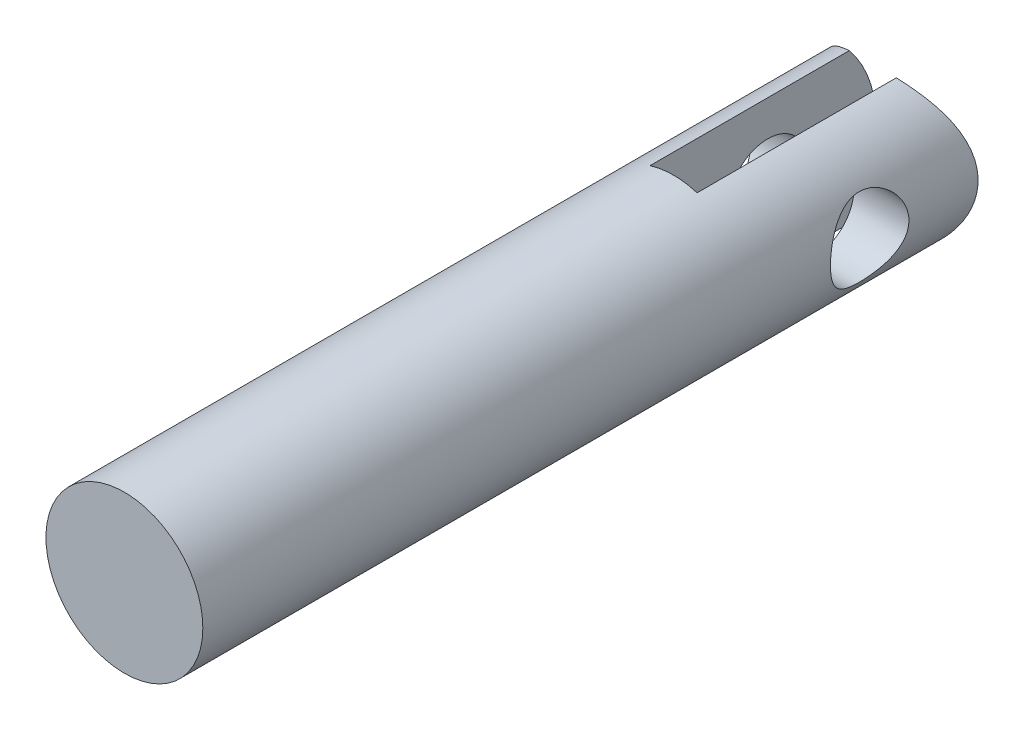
ISO-10303-21;
HEADER;
FILE_DESCRIPTION(('STEP AP214'),'2;1');
FILE_NAME('part.step','',(''),(''),'','','');
FILE_SCHEMA(('AUTOMOTIVE_DESIGN { 1 0 10303 214 1 1 1 1 }'));
ENDSEC;
DATA;
#1=APPLICATION_CONTEXT('core data for automotive mechanical design processes');
#2=APPLICATION_PROTOCOL_DEFINITION('international standard','automotive_design',2000,#1);
#3=PRODUCT_CONTEXT('',#1,'mechanical');
#4=PRODUCT('Part','Part','',(#3));
#5=PRODUCT_RELATED_PRODUCT_CATEGORY('part','',(#4));
#6=PRODUCT_DEFINITION_FORMATION('','',#4);
#7=PRODUCT_DEFINITION_CONTEXT('part definition',#1,'design');
#8=PRODUCT_DEFINITION('design','',#6,#7);
#9=PRODUCT_DEFINITION_SHAPE('','',#8);
#10=(LENGTH_UNIT() NAMED_UNIT(*) SI_UNIT(.MILLI.,.METRE.));
#11=(NAMED_UNIT(*) PLANE_ANGLE_UNIT() SI_UNIT($,.RADIAN.));
#12=(NAMED_UNIT(*) SI_UNIT($,.STERADIAN.) SOLID_ANGLE_UNIT());
#13=UNCERTAINTY_MEASURE_WITH_UNIT(LENGTH_MEASURE(1.E-05),#10,'distance_accuracy_value','');
#14=(GEOMETRIC_REPRESENTATION_CONTEXT(3) GLOBAL_UNCERTAINTY_ASSIGNED_CONTEXT((#13)) GLOBAL_UNIT_ASSIGNED_CONTEXT((#10,
#11,#12)) REPRESENTATION_CONTEXT('',''));
#15=CARTESIAN_POINT('',(0.,0.,0.));
#16=DIRECTION('',(0.,0.,1.));
#17=DIRECTION('',(1.,0.,0.));
#18=AXIS2_PLACEMENT_3D('',#15,#16,#17);
#19=CARTESIAN_POINT('',(0.,0.,95.));
#20=DIRECTION('',(0.,0.,-1.));
#21=DIRECTION('',(-1.,0.,0.));
#22=AXIS2_PLACEMENT_3D('',#19,#20,#21);
#23=CYLINDRICAL_SURFACE('',#22,10.);
#24=CARTESIAN_POINT('',(-10.,0.,15.));
#25=CARTESIAN_POINT('',(-9.99999960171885,-0.131488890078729,14.999999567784));
#26=CARTESIAN_POINT('',(-9.99740053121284,-0.262986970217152,14.9948072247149));
#27=CARTESIAN_POINT('',(-9.98706977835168,-0.525014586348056,14.974097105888));
#28=CARTESIAN_POINT('',(-9.97933586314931,-0.655543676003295,14.958574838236));
#29=CARTESIAN_POINT('',(-9.95892066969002,-0.914783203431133,14.9173592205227));
#30=CARTESIAN_POINT('',(-9.94623233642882,-1.04349077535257,14.8916513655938));
#31=CARTESIAN_POINT('',(-9.91622716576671,-1.29802636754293,14.8303493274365));
#32=CARTESIAN_POINT('',(-9.89890843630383,-1.42385318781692,14.7947511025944));
#33=CARTESIAN_POINT('',(-9.86015430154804,-1.67121386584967,14.7142215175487));
#34=CARTESIAN_POINT('',(-9.83873709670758,-1.79276399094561,14.6693313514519));
#35=CARTESIAN_POINT('',(-9.79224427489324,-2.0314444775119,14.5705512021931));
#36=CARTESIAN_POINT('',(-9.7671672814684,-2.14857315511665,14.5166578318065));
#37=CARTESIAN_POINT('',(-9.68730860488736,-2.49222561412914,14.342200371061));
#38=CARTESIAN_POINT('',(-9.6278546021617,-2.71128846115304,14.2087692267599));
#39=CARTESIAN_POINT('',(-9.49780663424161,-3.13758045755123,13.9023947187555));
#40=CARTESIAN_POINT('',(-9.42675632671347,-3.34329192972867,13.7275493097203));
#41=CARTESIAN_POINT('',(-9.28300214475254,-3.72388133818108,13.3474109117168));
#42=CARTESIAN_POINT('',(-9.21029705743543,-3.89873577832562,13.1420949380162));
#43=CARTESIAN_POINT('',(-9.06493867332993,-4.22628385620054,12.6875248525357));
#44=CARTESIAN_POINT('',(-8.99272664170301,-4.37620734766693,12.4360981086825));
#45=CARTESIAN_POINT('',(-8.89637417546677,-4.56723365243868,12.0400819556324));
#46=CARTESIAN_POINT('',(-8.86624279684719,-4.62527981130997,11.9048817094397));
#47=CARTESIAN_POINT('',(-8.81109611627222,-4.72948843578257,11.6289987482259));
#48=CARTESIAN_POINT('',(-8.78607778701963,-4.77565793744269,11.4883193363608));
#49=CARTESIAN_POINT('',(-8.74350562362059,-4.8531380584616,11.211007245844));
#50=CARTESIAN_POINT('',(-8.72559704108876,-4.88516762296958,11.0746295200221));
#51=CARTESIAN_POINT('',(-8.69596333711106,-4.93772573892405,10.7990743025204));
#52=CARTESIAN_POINT('',(-8.68423493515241,-4.95826039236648,10.6598983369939));
#53=CARTESIAN_POINT('',(-8.66746161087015,-4.98752398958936,10.3799925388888));
#54=CARTESIAN_POINT('',(-8.66241266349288,-4.99626004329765,10.2392636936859));
#55=CARTESIAN_POINT('',(-8.65921299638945,-5.00180399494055,9.9574988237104));
#56=CARTESIAN_POINT('',(-8.66106161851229,-4.99861303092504,9.81646282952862));
#57=CARTESIAN_POINT('',(-8.67093727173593,-4.98145803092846,9.55229642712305));
#58=CARTESIAN_POINT('',(-8.6781966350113,-4.96883208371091,9.4290473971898));
#59=CARTESIAN_POINT('',(-8.69773906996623,-4.93454402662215,9.18417878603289));
#60=CARTESIAN_POINT('',(-8.71002371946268,-4.91287907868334,9.06255972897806));
#61=CARTESIAN_POINT('',(-8.73921479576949,-4.86076278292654,8.82180212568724));
#62=CARTESIAN_POINT('',(-8.75612065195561,-4.83031251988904,8.70266327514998));
#63=CARTESIAN_POINT('',(-8.79403073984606,-4.76094319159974,8.46752862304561));
#64=CARTESIAN_POINT('',(-8.81503658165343,-4.72202079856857,8.35153407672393));
#65=CARTESIAN_POINT('',(-8.88436032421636,-4.59108661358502,8.00399312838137));
#66=CARTESIAN_POINT('',(-8.93828791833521,-4.48608785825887,7.77830664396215));
#67=CARTESIAN_POINT('',(-9.05517433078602,-4.24519591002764,7.34678988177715));
#68=CARTESIAN_POINT('',(-9.11813720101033,-4.10928884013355,7.14096858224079));
#69=CARTESIAN_POINT('',(-9.25565455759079,-3.79034422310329,6.72741147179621));
#70=CARTESIAN_POINT('',(-9.3306665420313,-3.60351571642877,6.52274199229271));
#71=CARTESIAN_POINT('',(-9.47739013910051,-3.19773444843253,6.14629653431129));
#72=CARTESIAN_POINT('',(-9.54910016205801,-2.97876642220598,5.97453627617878));
#73=CARTESIAN_POINT('',(-9.65034506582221,-2.62430600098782,5.74155910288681));
#74=CARTESIAN_POINT('',(-9.68370380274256,-2.4987100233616,5.66664790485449));
#75=CARTESIAN_POINT('',(-9.74663052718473,-2.24071060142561,5.52779179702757));
#76=CARTESIAN_POINT('',(-9.77620011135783,-2.1083100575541,5.46384226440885));
#77=CARTESIAN_POINT('',(-9.83067553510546,-1.83762803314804,5.34760112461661));
#78=CARTESIAN_POINT('',(-9.85558325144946,-1.69934894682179,5.29530482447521));
#79=CARTESIAN_POINT('',(-9.89999026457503,-1.41791187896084,5.20297507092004));
#80=CARTESIAN_POINT('',(-9.91949018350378,-1.27475446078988,5.16294020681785));
#81=CARTESIAN_POINT('',(-9.95109597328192,-0.996798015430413,5.09846643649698));
#82=CARTESIAN_POINT('',(-9.96368046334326,-0.862288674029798,5.07301048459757));
#83=CARTESIAN_POINT('',(-9.98343035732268,-0.591248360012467,5.0331919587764));
#84=CARTESIAN_POINT('',(-9.99059624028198,-0.454717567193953,5.01882840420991));
#85=CARTESIAN_POINT('',(-9.99930380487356,-0.180810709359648,5.00138683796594));
#86=CARTESIAN_POINT('',(-10.000847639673,-0.0434349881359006,4.99830450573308));
#87=CARTESIAN_POINT('',(-9.99827237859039,0.23104760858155,5.00345557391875));
#88=CARTESIAN_POINT('',(-9.99415353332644,0.368154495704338,5.01168847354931));
#89=CARTESIAN_POINT('',(-9.98090973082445,0.630324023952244,5.03827867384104));
#90=CARTESIAN_POINT('',(-9.97219922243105,0.755493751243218,5.05579837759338));
#91=CARTESIAN_POINT('',(-9.95027227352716,1.00380426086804,5.10017447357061));
#92=CARTESIAN_POINT('',(-9.93705440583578,1.12694438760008,5.12703382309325));
#93=CARTESIAN_POINT('',(-9.90642450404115,1.37032307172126,5.18980268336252));
#94=CARTESIAN_POINT('',(-9.88901375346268,1.49056250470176,5.22570942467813));
#95=CARTESIAN_POINT('',(-9.85039368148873,1.72747946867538,5.30622816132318));
#96=CARTESIAN_POINT('',(-9.82918290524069,1.84415561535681,5.35084349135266));
#97=CARTESIAN_POINT('',(-9.75922876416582,2.19430354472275,5.4999478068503));
#98=CARTESIAN_POINT('',(-9.70504904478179,2.42111320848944,5.61794074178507));
#99=CARTESIAN_POINT('',(-9.58719375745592,2.8523456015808,5.8855521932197));
#100=CARTESIAN_POINT('',(-9.5235141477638,3.05675873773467,6.03518418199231));
#101=CARTESIAN_POINT('',(-9.38541505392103,3.45882132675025,6.37878729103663));
#102=CARTESIAN_POINT('',(-9.31055499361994,3.65383533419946,6.57566959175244));
#103=CARTESIAN_POINT('',(-9.16310881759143,4.00930667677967,6.99967053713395));
#104=CARTESIAN_POINT('',(-9.09052430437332,4.16974010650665,7.22680992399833));
#105=CARTESIAN_POINT('',(-8.98785260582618,4.38466016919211,7.59249056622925));
#106=CARTESIAN_POINT('',(-8.95395955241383,4.4532676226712,7.72185087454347));
#107=CARTESIAN_POINT('',(-8.89022352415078,4.57918112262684,7.98689410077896));
#108=CARTESIAN_POINT('',(-8.86037871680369,4.63649228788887,8.12257412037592));
#109=CARTESIAN_POINT('',(-8.80590327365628,4.73913999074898,8.39927703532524));
#110=CARTESIAN_POINT('',(-8.78126837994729,4.78448631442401,8.54029545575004));
#111=CARTESIAN_POINT('',(-8.73822819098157,4.86265004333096,8.82669104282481));
#112=CARTESIAN_POINT('',(-8.7198219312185,4.89546938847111,8.97206753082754));
#113=CARTESIAN_POINT('',(-8.69151275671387,4.94553834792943,9.25176498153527));
#114=CARTESIAN_POINT('',(-8.6809632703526,4.96397997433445,9.38580788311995));
#115=CARTESIAN_POINT('',(-8.66606824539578,4.98993873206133,9.65528524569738));
#116=CARTESIAN_POINT('',(-8.66172205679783,4.99745700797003,9.79071955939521));
#117=CARTESIAN_POINT('',(-8.65941425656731,5.00145477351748,10.0617569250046));
#118=CARTESIAN_POINT('',(-8.66145040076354,4.99793814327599,10.1973599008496));
#119=CARTESIAN_POINT('',(-8.67181681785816,4.97992974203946,10.4675855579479));
#120=CARTESIAN_POINT('',(-8.68014683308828,4.96543842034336,10.6022082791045));
#121=CARTESIAN_POINT('',(-8.70167828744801,4.92759757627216,10.856560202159));
#122=CARTESIAN_POINT('',(-8.71433770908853,4.90522766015,10.9764825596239));
#123=CARTESIAN_POINT('',(-8.74411599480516,4.85194376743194,11.2138611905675));
#124=CARTESIAN_POINT('',(-8.76123623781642,4.82102714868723,11.331316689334));
#125=CARTESIAN_POINT('',(-8.81854231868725,4.71590306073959,11.6789171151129));
#126=CARTESIAN_POINT('',(-8.86468813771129,4.62929708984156,11.904456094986));
#127=CARTESIAN_POINT('',(-8.97142890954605,4.41907164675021,12.3531603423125));
#128=CARTESIAN_POINT('',(-9.03278633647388,4.29335633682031,12.5751480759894));
#129=CARTESIAN_POINT('',(-9.16176636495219,4.01075421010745,12.9963641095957));
#130=CARTESIAN_POINT('',(-9.22939221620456,3.85385117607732,13.1955804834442));
#131=CARTESIAN_POINT('',(-9.37311444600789,3.49102748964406,13.5907078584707));
#132=CARTESIAN_POINT('',(-9.44924162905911,3.28146736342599,13.7832760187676));
#133=CARTESIAN_POINT('',(-9.59389514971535,2.83072875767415,14.1313344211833));
#134=CARTESIAN_POINT('',(-9.66241737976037,2.58953334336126,14.2868046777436));
#135=CARTESIAN_POINT('',(-9.7541901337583,2.20753881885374,14.4886304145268));
#136=CARTESIAN_POINT('',(-9.78304209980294,2.0762551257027,14.5508670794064));
#137=CARTESIAN_POINT('',(-9.83614745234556,1.80799529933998,14.6639361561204));
#138=CARTESIAN_POINT('',(-9.8604030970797,1.67102200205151,14.7147741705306));
#139=CARTESIAN_POINT('',(-9.90354484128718,1.39269501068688,14.8043454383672));
#140=CARTESIAN_POINT('',(-9.92244264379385,1.25135162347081,14.8431050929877));
#141=CARTESIAN_POINT('',(-9.95434618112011,0.965237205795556,14.9081375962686));
#142=CARTESIAN_POINT('',(-9.96735551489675,0.820468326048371,14.934418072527));
#143=CARTESIAN_POINT('',(-9.98476387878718,0.563041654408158,14.9694745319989));
#144=CARTESIAN_POINT('',(-9.99046741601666,0.450825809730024,14.980911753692));
#145=CARTESIAN_POINT('',(-9.99808569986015,0.225742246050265,14.9961747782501));
#146=CARTESIAN_POINT('',(-10.000000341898,0.112874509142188,15.0000003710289));
#147=CARTESIAN_POINT('',(-10.,0.,15.));
#148=B_SPLINE_CURVE_WITH_KNOTS('',3,(#24,#25,#26,#27,#28,#29,#30,#31,#32,#33,#34,#35,#36,#37,
#38,#39,#40,#41,#42,#43,#44,#45,#46,#47,#48,#49,#50,#51,#52,#53,#54,#55,#56,#57,#58,#59,#60,#61,
#62,#63,#64,#65,#66,#67,#68,#69,#70,#71,#72,#73,#74,#75,#76,#77,#78,#79,#80,#81,#82,#83,#84,#85,
#86,#87,#88,#89,#90,#91,#92,#93,#94,#95,#96,#97,#98,#99,#100,#101,#102,#103,#104,#105,#106,#107,
#108,#109,#110,#111,#112,#113,#114,#115,#116,#117,#118,#119,#120,#121,#122,#123,#124,#125,#126,
#127,#128,#129,#130,#131,#132,#133,#134,#135,#136,#137,#138,#139,#140,#141,#142,#143,#144,#145,
#146,#147),.UNSPECIFIED.,.T.,.F.,(4,2,2,2,2,2,2,2,2,2,2,2,2,2,2,2,2,2,2,2,2,2,2,2,2,2,2,2,2,2,2,
2,2,2,2,2,2,2,2,2,2,2,2,2,2,2,2,2,2,2,2,2,2,2,2,2,2,2,2,2,2,4),(0.,0.39435529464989,
0.788882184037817,1.18397293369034,1.57922537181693,1.97276168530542,2.36644639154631,
3.15295441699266,3.98704440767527,4.821766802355,5.72122193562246,6.17125359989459,
6.62101803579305,7.04410338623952,7.46696393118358,7.88956954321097,8.3121348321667,
8.68401534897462,9.05601271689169,9.42796417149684,9.8000619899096,10.56083380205,
11.3219478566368,12.1795688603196,13.03759852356,13.4870830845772,13.9363776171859,
14.3854908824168,14.8345524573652,15.2464230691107,15.6582572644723,16.0699337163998,
16.4815919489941,16.8612200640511,17.240968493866,17.6206008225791,18.0003788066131,
18.7808755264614,19.5617052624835,20.4192132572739,21.2773121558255,21.7277011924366,
22.1778856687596,22.6277007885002,23.0774462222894,23.4840267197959,23.8905646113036,
24.2969595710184,24.703337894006,25.0708552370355,25.4384863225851,26.1732662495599,
26.9574126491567,27.7419678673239,28.6218519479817,29.5022089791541,29.9460734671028,
30.3897193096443,30.8323885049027,31.2747867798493,31.6133053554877,31.9518332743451),.UNSPECIFIED.);
#149=CARTESIAN_POINT('',(-10.,0.,15.));
#150=VERTEX_POINT('',#149);
#151=EDGE_CURVE('E97',#150,#150,#148,.T.);
#152=ORIENTED_EDGE('',*,*,#151,.T.);
#153=EDGE_LOOP('',(#152));
#154=FACE_BOUND('',#153,.T.);
#155=CARTESIAN_POINT('',(10.,0.,5.));
#156=CARTESIAN_POINT('',(9.99999960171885,-0.131488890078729,5.00000043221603));
#157=CARTESIAN_POINT('',(9.99740053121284,-0.262986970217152,5.00519277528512));
#158=CARTESIAN_POINT('',(9.98706977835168,-0.525014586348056,5.02590289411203));
#159=CARTESIAN_POINT('',(9.97933586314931,-0.655543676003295,5.04142516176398));
#160=CARTESIAN_POINT('',(9.95892066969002,-0.914783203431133,5.08264077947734));
#161=CARTESIAN_POINT('',(9.94623233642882,-1.04349077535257,5.10834863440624));
#162=CARTESIAN_POINT('',(9.91622716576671,-1.29802636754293,5.16965067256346));
#163=CARTESIAN_POINT('',(9.89890843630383,-1.42385318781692,5.20524889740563));
#164=CARTESIAN_POINT('',(9.86015430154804,-1.67121386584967,5.2857784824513));
#165=CARTESIAN_POINT('',(9.83873709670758,-1.79276399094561,5.33066864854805));
#166=CARTESIAN_POINT('',(9.79224427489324,-2.0314444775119,5.42944879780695));
#167=CARTESIAN_POINT('',(9.7671672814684,-2.14857315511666,5.48334216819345));
#168=CARTESIAN_POINT('',(9.68730860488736,-2.49222561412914,5.65779962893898));
#169=CARTESIAN_POINT('',(9.6278546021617,-2.71128846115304,5.79123077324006));
#170=CARTESIAN_POINT('',(9.49780663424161,-3.13758045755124,6.09760528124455));
#171=CARTESIAN_POINT('',(9.42675632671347,-3.34329192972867,6.27245069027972));
#172=CARTESIAN_POINT('',(9.28300214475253,-3.72388133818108,6.65258908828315));
#173=CARTESIAN_POINT('',(9.21029705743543,-3.89873577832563,6.85790506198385));
#174=CARTESIAN_POINT('',(9.06493867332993,-4.22628385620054,7.31247514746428));
#175=CARTESIAN_POINT('',(8.99272664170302,-4.37620734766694,7.56390189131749));
#176=CARTESIAN_POINT('',(8.89637417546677,-4.56723365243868,7.95991804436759));
#177=CARTESIAN_POINT('',(8.86624279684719,-4.62527981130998,8.09511829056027));
#178=CARTESIAN_POINT('',(8.81109611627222,-4.72948843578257,8.37100125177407));
#179=CARTESIAN_POINT('',(8.78607778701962,-4.77565793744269,8.51168066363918));
#180=CARTESIAN_POINT('',(8.74350562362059,-4.8531380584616,8.78899275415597));
#181=CARTESIAN_POINT('',(8.72559704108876,-4.88516762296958,8.92537047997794));
#182=CARTESIAN_POINT('',(8.69596333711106,-4.93772573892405,9.20092569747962));
#183=CARTESIAN_POINT('',(8.68423493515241,-4.95826039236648,9.34010166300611));
#184=CARTESIAN_POINT('',(8.66746161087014,-4.98752398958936,9.62000746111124));
#185=CARTESIAN_POINT('',(8.66241266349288,-4.99626004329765,9.7607363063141));
#186=CARTESIAN_POINT('',(8.65921299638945,-5.00180399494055,10.0425011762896));
#187=CARTESIAN_POINT('',(8.66106161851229,-4.99861303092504,10.1835371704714));
#188=CARTESIAN_POINT('',(8.67093727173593,-4.98145803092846,10.447703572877));
#189=CARTESIAN_POINT('',(8.6781966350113,-4.96883208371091,10.5709526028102));
#190=CARTESIAN_POINT('',(8.69773906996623,-4.93454402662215,10.8158212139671));
#191=CARTESIAN_POINT('',(8.71002371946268,-4.91287907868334,10.9374402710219));
#192=CARTESIAN_POINT('',(8.73921479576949,-4.86076278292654,11.1781978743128));
#193=CARTESIAN_POINT('',(8.75612065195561,-4.83031251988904,11.29733672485));
#194=CARTESIAN_POINT('',(8.79403073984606,-4.76094319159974,11.5324713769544));
#195=CARTESIAN_POINT('',(8.81503658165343,-4.72202079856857,11.6484659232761));
#196=CARTESIAN_POINT('',(8.88436032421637,-4.59108661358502,11.9960068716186));
#197=CARTESIAN_POINT('',(8.93828791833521,-4.48608785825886,12.2216933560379));
#198=CARTESIAN_POINT('',(9.05517433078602,-4.24519591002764,12.6532101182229));
#199=CARTESIAN_POINT('',(9.11813720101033,-4.10928884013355,12.8590314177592));
#200=CARTESIAN_POINT('',(9.25565455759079,-3.79034422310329,13.2725885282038));
#201=CARTESIAN_POINT('',(9.3306665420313,-3.60351571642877,13.4772580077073));
#202=CARTESIAN_POINT('',(9.47739013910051,-3.19773444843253,13.8537034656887));
#203=CARTESIAN_POINT('',(9.54910016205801,-2.97876642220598,14.0254637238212));
#204=CARTESIAN_POINT('',(9.65034506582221,-2.62430600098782,14.2584408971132));
#205=CARTESIAN_POINT('',(9.68370380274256,-2.49871002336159,14.3333520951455));
#206=CARTESIAN_POINT('',(9.74663052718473,-2.2407106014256,14.4722082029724));
#207=CARTESIAN_POINT('',(9.77620011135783,-2.1083100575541,14.5361577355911));
#208=CARTESIAN_POINT('',(9.83067553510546,-1.83762803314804,14.6523988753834));
#209=CARTESIAN_POINT('',(9.85558325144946,-1.69934894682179,14.7046951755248));
#210=CARTESIAN_POINT('',(9.89999026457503,-1.41791187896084,14.79702492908));
#211=CARTESIAN_POINT('',(9.91949018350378,-1.27475446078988,14.8370597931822));
#212=CARTESIAN_POINT('',(9.95109597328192,-0.996798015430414,14.901533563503));
#213=CARTESIAN_POINT('',(9.96368046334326,-0.862288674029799,14.9269895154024));
#214=CARTESIAN_POINT('',(9.98343035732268,-0.591248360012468,14.9668080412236));
#215=CARTESIAN_POINT('',(9.99059624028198,-0.454717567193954,14.9811715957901));
#216=CARTESIAN_POINT('',(9.99930380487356,-0.180810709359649,14.9986131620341));
#217=CARTESIAN_POINT('',(10.000847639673,-0.0434349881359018,15.0016954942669));
#218=CARTESIAN_POINT('',(9.99827237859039,0.231047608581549,14.9965444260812));
#219=CARTESIAN_POINT('',(9.99415353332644,0.368154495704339,14.9883115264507));
#220=CARTESIAN_POINT('',(9.98090973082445,0.630324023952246,14.961721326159));
#221=CARTESIAN_POINT('',(9.97219922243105,0.75549375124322,14.9442016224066));
#222=CARTESIAN_POINT('',(9.95027227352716,1.00380426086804,14.8998255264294));
#223=CARTESIAN_POINT('',(9.93705440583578,1.12694438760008,14.8729661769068));
#224=CARTESIAN_POINT('',(9.90642450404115,1.37032307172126,14.8101973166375));
#225=CARTESIAN_POINT('',(9.88901375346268,1.49056250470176,14.7742905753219));
#226=CARTESIAN_POINT('',(9.85039368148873,1.72747946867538,14.6937718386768));
#227=CARTESIAN_POINT('',(9.82918290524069,1.84415561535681,14.6491565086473));
#228=CARTESIAN_POINT('',(9.75922876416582,2.19430354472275,14.5000521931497));
#229=CARTESIAN_POINT('',(9.70504904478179,2.42111320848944,14.3820592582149));
#230=CARTESIAN_POINT('',(9.58719375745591,2.8523456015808,14.1144478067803));
#231=CARTESIAN_POINT('',(9.5235141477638,3.05675873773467,13.9648158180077));
#232=CARTESIAN_POINT('',(9.38541505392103,3.45882132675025,13.6212127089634));
#233=CARTESIAN_POINT('',(9.31055499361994,3.65383533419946,13.4243304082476));
#234=CARTESIAN_POINT('',(9.16310881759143,4.00930667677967,13.000329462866));
#235=CARTESIAN_POINT('',(9.09052430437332,4.16974010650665,12.7731900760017));
#236=CARTESIAN_POINT('',(8.98785260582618,4.38466016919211,12.4075094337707));
#237=CARTESIAN_POINT('',(8.95395955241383,4.4532676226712,12.2781491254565));
#238=CARTESIAN_POINT('',(8.89022352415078,4.57918112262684,12.013105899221));
#239=CARTESIAN_POINT('',(8.86037871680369,4.63649228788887,11.8774258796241));
#240=CARTESIAN_POINT('',(8.80590327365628,4.73913999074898,11.6007229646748));
#241=CARTESIAN_POINT('',(8.78126837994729,4.78448631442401,11.45970454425));
#242=CARTESIAN_POINT('',(8.73822819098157,4.86265004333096,11.1733089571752));
#243=CARTESIAN_POINT('',(8.7198219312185,4.89546938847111,11.0279324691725));
#244=CARTESIAN_POINT('',(8.69151275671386,4.94553834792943,10.7482350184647));
#245=CARTESIAN_POINT('',(8.6809632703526,4.96397997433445,10.61419211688));
#246=CARTESIAN_POINT('',(8.66606824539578,4.98993873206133,10.3447147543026));
#247=CARTESIAN_POINT('',(8.66172205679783,4.99745700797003,10.2092804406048));
#248=CARTESIAN_POINT('',(8.65941425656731,5.00145477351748,9.93824307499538));
#249=CARTESIAN_POINT('',(8.66145040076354,4.99793814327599,9.80264009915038));
#250=CARTESIAN_POINT('',(8.67181681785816,4.97992974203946,9.53241444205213));
#251=CARTESIAN_POINT('',(8.68014683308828,4.96543842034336,9.39779172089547));
#252=CARTESIAN_POINT('',(8.70167828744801,4.92759757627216,9.14343979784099));
#253=CARTESIAN_POINT('',(8.71433770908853,4.90522766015,9.02351744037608));
#254=CARTESIAN_POINT('',(8.74411599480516,4.85194376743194,8.78613880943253));
#255=CARTESIAN_POINT('',(8.76123623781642,4.82102714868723,8.66868331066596));
#256=CARTESIAN_POINT('',(8.81854231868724,4.71590306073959,8.3210828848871));
#257=CARTESIAN_POINT('',(8.86468813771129,4.62929708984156,8.095543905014));
#258=CARTESIAN_POINT('',(8.97142890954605,4.41907164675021,7.64683965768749));
#259=CARTESIAN_POINT('',(9.03278633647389,4.29335633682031,7.42485192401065));
#260=CARTESIAN_POINT('',(9.16176636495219,4.01075421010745,7.00363589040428));
#261=CARTESIAN_POINT('',(9.22939221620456,3.85385117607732,6.80441951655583));
#262=CARTESIAN_POINT('',(9.37311444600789,3.49102748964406,6.40929214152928));
#263=CARTESIAN_POINT('',(9.44924162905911,3.28146736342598,6.21672398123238));
#264=CARTESIAN_POINT('',(9.59389514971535,2.83072875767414,5.86866557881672));
#265=CARTESIAN_POINT('',(9.66241737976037,2.58953334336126,5.71319532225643));
#266=CARTESIAN_POINT('',(9.7541901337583,2.20753881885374,5.51136958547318));
#267=CARTESIAN_POINT('',(9.78304209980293,2.0762551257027,5.44913292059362));
#268=CARTESIAN_POINT('',(9.83614745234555,1.80799529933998,5.33606384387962));
#269=CARTESIAN_POINT('',(9.8604030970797,1.67102200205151,5.28522582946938));
#270=CARTESIAN_POINT('',(9.90354484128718,1.39269501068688,5.19565456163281));
#271=CARTESIAN_POINT('',(9.92244264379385,1.25135162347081,5.15689490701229));
#272=CARTESIAN_POINT('',(9.95434618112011,0.965237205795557,5.09186240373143));
#273=CARTESIAN_POINT('',(9.96735551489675,0.820468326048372,5.06558192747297));
#274=CARTESIAN_POINT('',(9.98476387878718,0.563041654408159,5.03052546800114));
#275=CARTESIAN_POINT('',(9.99046741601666,0.450825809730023,5.01908824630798));
#276=CARTESIAN_POINT('',(9.99808569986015,0.225742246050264,5.00382522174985));
#277=CARTESIAN_POINT('',(10.000000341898,0.112874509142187,4.99999962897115));
#278=CARTESIAN_POINT('',(10.,0.,5.));
#279=B_SPLINE_CURVE_WITH_KNOTS('',3,(#155,#156,#157,#158,#159,#160,#161,#162,#163,#164,#165,
#166,#167,#168,#169,#170,#171,#172,#173,#174,#175,#176,#177,#178,#179,#180,#181,#182,#183,#184,
#185,#186,#187,#188,#189,#190,#191,#192,#193,#194,#195,#196,#197,#198,#199,#200,#201,#202,#203,
#204,#205,#206,#207,#208,#209,#210,#211,#212,#213,#214,#215,#216,#217,#218,#219,#220,#221,#222,
#223,#224,#225,#226,#227,#228,#229,#230,#231,#232,#233,#234,#235,#236,#237,#238,#239,#240,#241,
#242,#243,#244,#245,#246,#247,#248,#249,#250,#251,#252,#253,#254,#255,#256,#257,#258,#259,#260,
#261,#262,#263,#264,#265,#266,#267,#268,#269,#270,#271,#272,#273,#274,#275,#276,#277,#278),
.UNSPECIFIED.,.T.,.F.,(4,2,2,2,2,2,2,2,2,2,2,2,2,2,2,2,2,2,2,2,2,2,2,2,2,2,2,2,2,2,2,2,2,2,2,2,
2,2,2,2,2,2,2,2,2,2,2,2,2,2,2,2,2,2,2,2,2,2,2,2,2,4),(0.,0.39435529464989,0.788882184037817,
1.18397293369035,1.57922537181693,1.97276168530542,2.36644639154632,3.15295441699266,
3.98704440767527,4.821766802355,5.72122193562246,6.17125359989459,6.62101803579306,
7.04410338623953,7.46696393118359,7.88956954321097,8.31213483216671,8.68401534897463,
9.05601271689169,9.42796417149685,9.8000619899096,10.56083380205,11.3219478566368,
12.1795688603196,13.03759852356,13.4870830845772,13.9363776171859,14.3854908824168,
14.8345524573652,15.2464230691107,15.6582572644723,16.0699337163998,16.4815919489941,
16.8612200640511,17.240968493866,17.6206008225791,18.0003788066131,18.7808755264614,
19.5617052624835,20.4192132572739,21.2773121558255,21.7277011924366,22.1778856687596,
22.6277007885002,23.0774462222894,23.4840267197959,23.8905646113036,24.2969595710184,
24.703337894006,25.0708552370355,25.4384863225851,26.1732662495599,26.9574126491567,
27.7419678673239,28.6218519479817,29.5022089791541,29.9460734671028,30.3897193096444,
30.8323885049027,31.2747867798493,31.6133053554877,31.9518332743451),.UNSPECIFIED.);
#280=CARTESIAN_POINT('',(10.,0.,5.));
#281=VERTEX_POINT('',#280);
#282=EDGE_CURVE('E130',#281,#281,#279,.T.);
#283=ORIENTED_EDGE('',*,*,#282,.T.);
#284=EDGE_LOOP('',(#283));
#285=FACE_BOUND('',#284,.T.);
#286=CARTESIAN_POINT('',(0.,0.,95.));
#287=DIRECTION('',(0.,0.,1.));
#288=DIRECTION('',(1.,0.,0.));
#289=AXIS2_PLACEMENT_3D('',#286,#287,#288);
#290=CIRCLE('',#289,10.);
#291=CARTESIAN_POINT('',(10.,0.,95.));
#292=VERTEX_POINT('',#291);
#293=EDGE_CURVE('E11',#292,#292,#290,.T.);
#294=ORIENTED_EDGE('',*,*,#293,.F.);
#295=EDGE_LOOP('',(#294));
#296=FACE_BOUND('',#295,.T.);
#297=DIRECTION('',(0.,0.,-1.));
#298=VECTOR('',#297,1.);
#299=CARTESIAN_POINT('',(3.,9.53939201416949,25.));
#300=LINE('',#299,#298);
#301=CARTESIAN_POINT('',(3.,9.53939201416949,25.));
#302=VERTEX_POINT('',#301);
#303=CARTESIAN_POINT('',(3.,9.53939201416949,-0.395497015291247));
#304=VERTEX_POINT('',#303);
#305=EDGE_CURVE('E83',#302,#304,#300,.T.);
#306=ORIENTED_EDGE('',*,*,#305,.F.);
#307=CARTESIAN_POINT('',(0.,0.,25.));
#308=DIRECTION('',(0.,0.,1.));
#309=DIRECTION('',(1.,0.,0.));
#310=AXIS2_PLACEMENT_3D('',#307,#308,#309);
#311=CIRCLE('',#310,10.);
#312=CARTESIAN_POINT('',(-3.,9.53939201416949,25.));
#313=VERTEX_POINT('',#312);
#314=EDGE_CURVE('E157',#302,#313,#311,.T.);
#315=ORIENTED_EDGE('',*,*,#314,.T.);
#316=DIRECTION('',(0.,0.,-1.));
#317=VECTOR('',#316,1.);
#318=CARTESIAN_POINT('',(-3.,9.53939201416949,25.));
#319=LINE('',#318,#317);
#320=CARTESIAN_POINT('',(-3.,9.53939201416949,-0.395497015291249));
#321=VERTEX_POINT('',#320);
#322=EDGE_CURVE('E152',#313,#321,#319,.T.);
#323=ORIENTED_EDGE('',*,*,#322,.T.);
#324=CARTESIAN_POINT('',(0.,10.,0.));
#325=CARTESIAN_POINT('',(0.243783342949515,9.99999702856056,-5.13300925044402E-06));
#326=CARTESIAN_POINT('',(0.487663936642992,9.99106351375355,-0.00801300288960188));
#327=CARTESIAN_POINT('',(0.973228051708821,9.95550999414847,-0.039658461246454));
#328=CARTESIAN_POINT('',(1.21490974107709,9.92887640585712,-0.0633080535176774));
#329=CARTESIAN_POINT('',(1.69449589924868,9.85837603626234,-0.125172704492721));
#330=CARTESIAN_POINT('',(1.93238875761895,9.81446410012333,-0.163425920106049));
#331=CARTESIAN_POINT('',(2.40215800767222,9.71017941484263,-0.25281893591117));
#332=CARTESIAN_POINT('',(2.63403105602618,9.64979772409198,-0.303965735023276));
#333=CARTESIAN_POINT('',(3.08797325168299,9.51419646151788,-0.41654441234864));
#334=CARTESIAN_POINT('',(3.31012042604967,9.43914148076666,-0.477861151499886));
#335=CARTESIAN_POINT('',(3.74627679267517,9.27468384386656,-0.609118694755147));
#336=CARTESIAN_POINT('',(3.96028725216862,9.1852834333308,-0.679058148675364));
#337=CARTESIAN_POINT('',(4.58929345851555,8.89668829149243,-0.898863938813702));
#338=CARTESIAN_POINT('',(4.99163494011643,8.67698697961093,-1.05881561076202));
#339=CARTESIAN_POINT('',(5.59671088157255,8.29132325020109,-1.32099255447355));
#340=CARTESIAN_POINT('',(5.81207917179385,8.14176101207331,-1.41912128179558));
#341=CARTESIAN_POINT('',(6.22991257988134,7.82665890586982,-1.61723745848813));
#342=CARTESIAN_POINT('',(6.43238005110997,7.66112196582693,-1.71722456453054));
#343=CARTESIAN_POINT('',(6.82404156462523,7.31443432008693,-1.91695503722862));
#344=CARTESIAN_POINT('',(7.01322050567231,7.13326635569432,-2.01669800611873));
#345=CARTESIAN_POINT('',(7.37739272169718,6.75594711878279,-2.21378144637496));
#346=CARTESIAN_POINT('',(7.55238502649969,6.55979482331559,-2.31112175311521));
#347=CARTESIAN_POINT('',(7.91159230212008,6.12353514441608,-2.51522098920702));
#348=CARTESIAN_POINT('',(8.09347191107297,5.88117633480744,-2.62130201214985));
#349=CARTESIAN_POINT('',(8.4359118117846,5.37846281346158,-2.82486136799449));
#350=CARTESIAN_POINT('',(8.59647480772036,5.11811039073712,-2.92234079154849));
#351=CARTESIAN_POINT('',(8.89438369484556,4.58085187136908,-3.10588802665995));
#352=CARTESIAN_POINT('',(9.03174640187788,4.30395796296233,-3.19196409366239));
#353=CARTESIAN_POINT('',(9.2813875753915,3.73526612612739,-3.35013932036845));
#354=CARTESIAN_POINT('',(9.39367141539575,3.44347140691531,-3.42224147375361));
#355=CARTESIAN_POINT('',(9.58011207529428,2.88082899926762,-3.54291012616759));
#356=CARTESIAN_POINT('',(9.65713217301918,2.6113007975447,-3.59320904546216));
#357=CARTESIAN_POINT('',(9.78860209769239,2.06453267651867,-3.67948056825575));
#358=CARTESIAN_POINT('',(9.84305344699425,1.78729327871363,-3.71545413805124));
#359=CARTESIAN_POINT('',(9.9283488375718,1.22794332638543,-3.77195393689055));
#360=CARTESIAN_POINT('',(9.95921762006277,0.945838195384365,-3.79249635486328));
#361=CARTESIAN_POINT('',(9.99683237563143,0.379329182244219,-3.81754176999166));
#362=CARTESIAN_POINT('',(10.0035817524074,0.0949256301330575,-3.82204703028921));
#363=CARTESIAN_POINT('',(9.9936594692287,-0.429890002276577,-3.81543397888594));
#364=CARTESIAN_POINT('',(9.98039847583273,-0.670404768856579,-3.80659076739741));
#365=CARTESIAN_POINT('',(9.93665840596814,-1.14916802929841,-3.77749786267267));
#366=CARTESIAN_POINT('',(9.90617970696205,-1.38741657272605,-3.75724841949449));
#367=CARTESIAN_POINT('',(9.82842632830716,-1.85993998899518,-3.7057985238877));
#368=CARTESIAN_POINT('',(9.78115177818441,-2.09421489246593,-3.67459815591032));
#369=CARTESIAN_POINT('',(9.6704192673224,-2.55727775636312,-3.60192193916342));
#370=CARTESIAN_POINT('',(9.60696060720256,-2.78606547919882,-3.560445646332));
#371=CARTESIAN_POINT('',(9.46491439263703,-3.23585987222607,-3.46826749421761));
#372=CARTESIAN_POINT('',(9.38639222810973,-3.45689545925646,-3.41760555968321));
#373=CARTESIAN_POINT('',(9.21483749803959,-3.89118270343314,-3.30789260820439));
#374=CARTESIAN_POINT('',(9.12180016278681,-4.10443177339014,-3.24883883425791));
#375=CARTESIAN_POINT('',(8.92210148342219,-4.52213262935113,-3.12343088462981));
#376=CARTESIAN_POINT('',(8.81544377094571,-4.72658674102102,-3.05707865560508));
#377=CARTESIAN_POINT('',(8.58926751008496,-5.12612990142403,-2.91815473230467));
#378=CARTESIAN_POINT('',(8.46974436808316,-5.32121556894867,-2.84558081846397));
#379=CARTESIAN_POINT('',(8.20216520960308,-5.72633268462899,-2.68553735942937));
#380=CARTESIAN_POINT('',(8.05242265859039,-5.93497240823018,-2.59736212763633));
#381=CARTESIAN_POINT('',(7.73842132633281,-6.33895305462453,-2.4162298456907));
#382=CARTESIAN_POINT('',(7.57415607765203,-6.53428798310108,-2.32327067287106));
#383=CARTESIAN_POINT('',(7.23175998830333,-6.91133768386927,-2.13423648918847));
#384=CARTESIAN_POINT('',(7.05361020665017,-7.09303316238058,-2.03815733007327));
#385=CARTESIAN_POINT('',(6.68440374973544,-7.4419925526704,-1.84488647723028));
#386=CARTESIAN_POINT('',(6.49335130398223,-7.6092611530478,-1.74769515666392));
#387=CARTESIAN_POINT('',(6.0681548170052,-7.95384017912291,-1.53905602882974));
#388=CARTESIAN_POINT('',(5.8319284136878,-8.12867089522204,-1.42774016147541));
#389=CARTESIAN_POINT('',(5.34355338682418,-8.45772734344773,-1.20940783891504));
#390=CARTESIAN_POINT('',(5.09140105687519,-8.61194825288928,-1.10239239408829));
#391=CARTESIAN_POINT('',(4.57221287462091,-8.89846481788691,-0.896431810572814));
#392=CARTESIAN_POINT('',(4.30519570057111,-9.03078719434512,-0.797476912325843));
#393=CARTESIAN_POINT('',(3.75679342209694,-9.2723363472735,-0.611480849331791));
#394=CARTESIAN_POINT('',(3.47540748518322,-9.38156178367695,-0.524440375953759));
#395=CARTESIAN_POINT('',(2.98041642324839,-9.54803274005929,-0.388720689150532));
#396=CARTESIAN_POINT('',(2.76988559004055,-9.61127015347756,-0.336123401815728));
#397=CARTESIAN_POINT('',(2.34308742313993,-9.72412503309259,-0.240992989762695));
#398=CARTESIAN_POINT('',(2.12682396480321,-9.77375145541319,-0.198453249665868));
#399=CARTESIAN_POINT('',(1.69017979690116,-9.85863206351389,-0.12499176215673));
#400=CARTESIAN_POINT('',(1.46981214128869,-9.89392565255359,-0.0940381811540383));
#401=CARTESIAN_POINT('',(1.02589546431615,-9.94974950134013,-0.0448055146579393));
#402=CARTESIAN_POINT('',(0.802348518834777,-9.97028898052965,-0.0265185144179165));
#403=CARTESIAN_POINT('',(0.481929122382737,-9.98884564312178,-0.00996857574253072));
#404=CARTESIAN_POINT('',(0.385642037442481,-9.99302611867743,-0.00623441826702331));
#405=CARTESIAN_POINT('',(0.192908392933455,-9.99860411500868,-0.00124890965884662));
#406=CARTESIAN_POINT('',(0.096461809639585,-10.0000011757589,2.03106314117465E-06));
#407=CARTESIAN_POINT('',(-0.243783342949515,-9.99999702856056,-5.13300925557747E-06));
#408=CARTESIAN_POINT('',(-0.487663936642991,-9.99106351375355,-0.00801300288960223));
#409=CARTESIAN_POINT('',(-0.97322805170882,-9.95550999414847,-0.0396584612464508));
#410=CARTESIAN_POINT('',(-1.21490974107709,-9.92887640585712,-0.0633080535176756));
#411=CARTESIAN_POINT('',(-1.69449589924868,-9.85837603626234,-0.12517270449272));
#412=CARTESIAN_POINT('',(-1.93238875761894,-9.81446410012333,-0.163425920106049));
#413=CARTESIAN_POINT('',(-2.40215800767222,-9.71017941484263,-0.25281893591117));
#414=CARTESIAN_POINT('',(-2.63403105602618,-9.64979772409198,-0.303965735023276));
#415=CARTESIAN_POINT('',(-3.087973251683,-9.51419646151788,-0.41654441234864));
#416=CARTESIAN_POINT('',(-3.31012042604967,-9.43914148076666,-0.477861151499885));
#417=CARTESIAN_POINT('',(-3.74627679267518,-9.27468384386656,-0.609118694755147));
#418=CARTESIAN_POINT('',(-3.96028725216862,-9.1852834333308,-0.679058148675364));
#419=CARTESIAN_POINT('',(-4.58929345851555,-8.89668829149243,-0.898863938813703));
#420=CARTESIAN_POINT('',(-4.99163494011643,-8.67698697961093,-1.05881561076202));
#421=CARTESIAN_POINT('',(-5.59671088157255,-8.29132325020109,-1.32099255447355));
#422=CARTESIAN_POINT('',(-5.81207917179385,-8.14176101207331,-1.41912128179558));
#423=CARTESIAN_POINT('',(-6.22991257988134,-7.82665890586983,-1.61723745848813));
#424=CARTESIAN_POINT('',(-6.43238005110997,-7.66112196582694,-1.71722456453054));
#425=CARTESIAN_POINT('',(-6.82404156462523,-7.31443432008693,-1.91695503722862));
#426=CARTESIAN_POINT('',(-7.01322050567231,-7.13326635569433,-2.01669800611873));
#427=CARTESIAN_POINT('',(-7.37739272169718,-6.75594711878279,-2.21378144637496));
#428=CARTESIAN_POINT('',(-7.55238502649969,-6.55979482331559,-2.31112175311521));
#429=CARTESIAN_POINT('',(-7.91159230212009,-6.12353514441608,-2.51522098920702));
#430=CARTESIAN_POINT('',(-8.09347191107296,-5.88117633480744,-2.62130201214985));
#431=CARTESIAN_POINT('',(-8.43591181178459,-5.37846281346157,-2.82486136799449));
#432=CARTESIAN_POINT('',(-8.59647480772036,-5.11811039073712,-2.92234079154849));
#433=CARTESIAN_POINT('',(-8.89438369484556,-4.58085187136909,-3.10588802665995));
#434=CARTESIAN_POINT('',(-9.03174640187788,-4.30395796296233,-3.19196409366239));
#435=CARTESIAN_POINT('',(-9.2813875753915,-3.73526612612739,-3.35013932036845));
#436=CARTESIAN_POINT('',(-9.39367141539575,-3.44347140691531,-3.42224147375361));
#437=CARTESIAN_POINT('',(-9.58011207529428,-2.88082899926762,-3.54291012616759));
#438=CARTESIAN_POINT('',(-9.65713217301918,-2.6113007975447,-3.59320904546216));
#439=CARTESIAN_POINT('',(-9.78860209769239,-2.06453267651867,-3.67948056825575));
#440=CARTESIAN_POINT('',(-9.84305344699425,-1.78729327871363,-3.71545413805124));
#441=CARTESIAN_POINT('',(-9.9283488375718,-1.22794332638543,-3.77195393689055));
#442=CARTESIAN_POINT('',(-9.95921762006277,-0.945838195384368,-3.79249635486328));
#443=CARTESIAN_POINT('',(-9.99683237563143,-0.379329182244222,-3.81754176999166));
#444=CARTESIAN_POINT('',(-10.0035817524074,-0.0949256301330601,-3.82204703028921));
#445=CARTESIAN_POINT('',(-9.9936594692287,0.429890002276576,-3.81543397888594));
#446=CARTESIAN_POINT('',(-9.98039847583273,0.670404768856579,-3.80659076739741));
#447=CARTESIAN_POINT('',(-9.93665840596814,1.14916802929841,-3.77749786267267));
#448=CARTESIAN_POINT('',(-9.90617970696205,1.38741657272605,-3.75724841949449));
#449=CARTESIAN_POINT('',(-9.82842632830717,1.85993998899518,-3.7057985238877));
#450=CARTESIAN_POINT('',(-9.78115177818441,2.09421489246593,-3.67459815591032));
#451=CARTESIAN_POINT('',(-9.6704192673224,2.55727775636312,-3.60192193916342));
#452=CARTESIAN_POINT('',(-9.60696060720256,2.78606547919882,-3.560445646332));
#453=CARTESIAN_POINT('',(-9.46491439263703,3.23585987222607,-3.46826749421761));
#454=CARTESIAN_POINT('',(-9.38639222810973,3.45689545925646,-3.41760555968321));
#455=CARTESIAN_POINT('',(-9.21483749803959,3.89118270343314,-3.3078926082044));
#456=CARTESIAN_POINT('',(-9.12180016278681,4.10443177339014,-3.24883883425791));
#457=CARTESIAN_POINT('',(-8.92210148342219,4.52213262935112,-3.12343088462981));
#458=CARTESIAN_POINT('',(-8.81544377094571,4.72658674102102,-3.05707865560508));
#459=CARTESIAN_POINT('',(-8.58926751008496,5.12612990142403,-2.91815473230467));
#460=CARTESIAN_POINT('',(-8.46974436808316,5.32121556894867,-2.84558081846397));
#461=CARTESIAN_POINT('',(-8.20216520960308,5.72633268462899,-2.68553735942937));
#462=CARTESIAN_POINT('',(-8.05242265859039,5.93497240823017,-2.59736212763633));
#463=CARTESIAN_POINT('',(-7.73842132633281,6.33895305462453,-2.4162298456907));
#464=CARTESIAN_POINT('',(-7.57415607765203,6.53428798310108,-2.32327067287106));
#465=CARTESIAN_POINT('',(-7.23175998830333,6.91133768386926,-2.13423648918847));
#466=CARTESIAN_POINT('',(-7.05361020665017,7.09303316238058,-2.03815733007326));
#467=CARTESIAN_POINT('',(-6.68440374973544,7.4419925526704,-1.84488647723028));
#468=CARTESIAN_POINT('',(-6.49335130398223,7.6092611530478,-1.74769515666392));
#469=CARTESIAN_POINT('',(-6.0681548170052,7.95384017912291,-1.53905602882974));
#470=CARTESIAN_POINT('',(-5.8319284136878,8.12867089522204,-1.42774016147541));
#471=CARTESIAN_POINT('',(-5.34355338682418,8.45772734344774,-1.20940783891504));
#472=CARTESIAN_POINT('',(-5.09140105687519,8.61194825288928,-1.10239239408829));
#473=CARTESIAN_POINT('',(-4.57221287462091,8.89846481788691,-0.896431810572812));
#474=CARTESIAN_POINT('',(-4.30519570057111,9.03078719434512,-0.797476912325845));
#475=CARTESIAN_POINT('',(-3.75679342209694,9.2723363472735,-0.611480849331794));
#476=CARTESIAN_POINT('',(-3.47540748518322,9.38156178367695,-0.52444037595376));
#477=CARTESIAN_POINT('',(-2.98041642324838,9.54803274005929,-0.388720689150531));
#478=CARTESIAN_POINT('',(-2.76988559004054,9.61127015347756,-0.336123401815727));
#479=CARTESIAN_POINT('',(-2.34308742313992,9.7241250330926,-0.240992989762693));
#480=CARTESIAN_POINT('',(-2.1268239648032,9.77375145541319,-0.198453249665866));
#481=CARTESIAN_POINT('',(-1.69017979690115,9.8586320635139,-0.124991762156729));
#482=CARTESIAN_POINT('',(-1.46981214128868,9.89392565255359,-0.0940381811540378));
#483=CARTESIAN_POINT('',(-1.02589546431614,9.94974950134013,-0.044805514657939));
#484=CARTESIAN_POINT('',(-0.802348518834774,9.97028898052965,-0.0265185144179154));
#485=CARTESIAN_POINT('',(-0.481929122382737,9.98884564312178,-0.0099685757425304));
#486=CARTESIAN_POINT('',(-0.385642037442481,9.99302611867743,-0.00623441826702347));
#487=CARTESIAN_POINT('',(-0.192908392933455,9.99860411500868,-0.00124890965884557));
#488=CARTESIAN_POINT('',(-0.0964618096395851,10.0000011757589,2.03106314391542E-06));
#489=CARTESIAN_POINT('',(0.,10.,0.));
#490=B_SPLINE_CURVE_WITH_KNOTS('',3,(#324,#325,#326,#327,#328,#329,#330,#331,#332,#333,#334,
#335,#336,#337,#338,#339,#340,#341,#342,#343,#344,#345,#346,#347,#348,#349,#350,#351,#352,#353,
#354,#355,#356,#357,#358,#359,#360,#361,#362,#363,#364,#365,#366,#367,#368,#369,#370,#371,#372,
#373,#374,#375,#376,#377,#378,#379,#380,#381,#382,#383,#384,#385,#386,#387,#388,#389,#390,#391,
#392,#393,#394,#395,#396,#397,#398,#399,#400,#401,#402,#403,#404,#405,#406,#407,#408,#409,#410,
#411,#412,#413,#414,#415,#416,#417,#418,#419,#420,#421,#422,#423,#424,#425,#426,#427,#428,#429,
#430,#431,#432,#433,#434,#435,#436,#437,#438,#439,#440,#441,#442,#443,#444,#445,#446,#447,#448,
#449,#450,#451,#452,#453,#454,#455,#456,#457,#458,#459,#460,#461,#462,#463,#464,#465,#466,#467,
#468,#469,#470,#471,#472,#473,#474,#475,#476,#477,#478,#479,#480,#481,#482,#483,#484,#485,#486,
#487,#488,#489),.UNSPECIFIED.,.T.,.F.,(4,2,2,2,2,2,2,2,2,2,2,2,2,2,2,2,2,2,2,2,2,2,2,2,2,2,2,2,
2,2,2,2,2,2,2,2,2,2,2,2,2,2,2,2,2,2,2,2,2,2,2,2,2,2,2,2,2,2,2,2,2,2,2,2,2,2,2,2,2,2,2,2,2,2,2,2,
2,2,2,2,2,2,4),(0.,0.731229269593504,1.46302035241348,2.19673672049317,2.93085222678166,
3.65716219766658,4.38335858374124,5.83456314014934,6.67388088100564,7.51304507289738,
8.35314796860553,9.19330826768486,10.1551588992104,11.1168873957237,12.0779158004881,
13.0387380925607,13.8918341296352,14.7448726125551,15.5970149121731,16.4490369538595,
17.1712882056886,17.8935236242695,18.6157534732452,19.3380145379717,20.0572084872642,
20.7766392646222,21.4958786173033,22.2153756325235,23.0291616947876,23.843312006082,
24.6585930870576,25.4736082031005,26.4152924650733,27.3571966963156,28.2979429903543,
29.2387438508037,29.9162015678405,30.5932124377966,31.2683492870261,31.9430638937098,
32.2323537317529,32.5216913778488,33.2529206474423,33.9847117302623,34.718428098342,
35.4525436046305,36.1788535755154,36.9050499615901,38.3562545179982,39.1955722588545,
40.0347364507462,40.8748393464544,41.7149996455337,42.6768502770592,43.6385787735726,
44.5996071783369,45.5604294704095,46.413525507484,47.2665639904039,48.1187062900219,
48.9707283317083,49.6929795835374,50.4152150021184,51.137444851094,51.8597059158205,
52.578899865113,53.298330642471,54.0175699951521,54.7370670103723,55.5508530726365,
56.3650033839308,57.1802844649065,57.9952995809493,58.9369838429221,59.8788880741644,
60.8196343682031,61.7604352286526,62.4378929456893,63.1149038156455,63.790040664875,
64.4647552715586,64.7540451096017,65.0433827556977),.UNSPECIFIED.);
#491=CARTESIAN_POINT('',(-3.,-9.53939201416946,-0.395497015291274));
#492=VERTEX_POINT('',#491);
#493=EDGE_CURVE('E94',#492,#321,#490,.T.);
#494=ORIENTED_EDGE('',*,*,#493,.F.);
#495=DIRECTION('',(0.,0.,-1.));
#496=VECTOR('',#495,1.);
#497=CARTESIAN_POINT('',(-3.,-9.53939201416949,25.));
#498=LINE('',#497,#496);
#499=CARTESIAN_POINT('',(-3.,-9.53939201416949,25.));
#500=VERTEX_POINT('',#499);
#501=EDGE_CURVE('E51',#500,#492,#498,.T.);
#502=ORIENTED_EDGE('',*,*,#501,.F.);
#503=CARTESIAN_POINT('',(0.,0.,25.));
#504=DIRECTION('',(0.,0.,1.));
#505=DIRECTION('',(1.,0.,0.));
#506=AXIS2_PLACEMENT_3D('',#503,#504,#505);
#507=CIRCLE('',#506,10.);
#508=CARTESIAN_POINT('',(3.,-9.53939201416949,25.));
#509=VERTEX_POINT('',#508);
#510=EDGE_CURVE('E90',#500,#509,#507,.T.);
#511=ORIENTED_EDGE('',*,*,#510,.T.);
#512=DIRECTION('',(0.,0.,-1.));
#513=VECTOR('',#512,1.);
#514=CARTESIAN_POINT('',(3.,-9.53939201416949,25.));
#515=LINE('',#514,#513);
#516=CARTESIAN_POINT('',(3.,-9.53939201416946,-0.395497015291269));
#517=VERTEX_POINT('',#516);
#518=EDGE_CURVE('E80',#509,#517,#515,.T.);
#519=ORIENTED_EDGE('',*,*,#518,.T.);
#520=EDGE_CURVE('E43',#304,#517,#490,.T.);
#521=ORIENTED_EDGE('',*,*,#520,.F.);
#522=EDGE_LOOP('',(#306,#315,#323,#494,#502,#511,#519,#521));
#523=FACE_BOUND('',#522,.T.);
#524=ADVANCED_FACE('F34',(#154,#285,#296,#523),#23,.T.);
#525=CARTESIAN_POINT('',(10.001,0.,11.1803398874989));
#526=DIRECTION('',(-1.,0.,0.));
#527=DIRECTION('',(0.,0.,1.));
#528=AXIS2_PLACEMENT_3D('',#525,#526,#527);
#529=CYLINDRICAL_SURFACE('',#528,15.);
#530=CARTESIAN_POINT('',(3.,0.,11.1803398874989));
#531=DIRECTION('',(1.,0.,0.));
#532=DIRECTION('',(0.,0.,-1.));
#533=AXIS2_PLACEMENT_3D('',#530,#531,#532);
#534=CIRCLE('',#533,15.);
#535=EDGE_CURVE('E76',#304,#517,#534,.F.);
#536=ORIENTED_EDGE('',*,*,#535,.F.);
#537=ORIENTED_EDGE('',*,*,#520,.T.);
#538=EDGE_LOOP('',(#536,#537));
#539=FACE_BOUND('',#538,.T.);
#540=ADVANCED_FACE('F93',(#539),#529,.T.);
#541=CARTESIAN_POINT('',(-3.,0.,11.1803398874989));
#542=DIRECTION('',(-1.,0.,0.));
#543=DIRECTION('',(0.,0.,1.));
#544=AXIS2_PLACEMENT_3D('',#541,#542,#543);
#545=CIRCLE('',#544,15.);
#546=EDGE_CURVE('E87',#492,#321,#545,.F.);
#547=ORIENTED_EDGE('',*,*,#546,.F.);
#548=ORIENTED_EDGE('',*,*,#493,.T.);
#549=EDGE_LOOP('',(#547,#548));
#550=FACE_BOUND('',#549,.T.);
#551=ADVANCED_FACE('F106',(#550),#529,.T.);
#552=CARTESIAN_POINT('',(-50.,0.,10.));
#553=DIRECTION('',(1.,0.,0.));
#554=DIRECTION('',(0.,0.,-1.));
#555=AXIS2_PLACEMENT_3D('',#552,#553,#554);
#556=CYLINDRICAL_SURFACE('',#555,5.);
#557=ORIENTED_EDGE('',*,*,#282,.F.);
#558=EDGE_LOOP('',(#557));
#559=FACE_BOUND('',#558,.T.);
#560=CARTESIAN_POINT('',(3.,0.,10.));
#561=DIRECTION('',(-1.,0.,0.));
#562=DIRECTION('',(0.,0.,1.));
#563=AXIS2_PLACEMENT_3D('',#560,#561,#562);
#564=CIRCLE('',#563,5.);
#565=CARTESIAN_POINT('',(3.,0.,15.));
#566=VERTEX_POINT('',#565);
#567=EDGE_CURVE('E38',#566,#566,#564,.F.);
#568=ORIENTED_EDGE('',*,*,#567,.F.);
#569=EDGE_LOOP('',(#568));
#570=FACE_BOUND('',#569,.T.);
#571=ADVANCED_FACE('F107',(#559,#570),#556,.F.);
#572=ORIENTED_EDGE('',*,*,#151,.F.);
#573=EDGE_LOOP('',(#572));
#574=FACE_BOUND('',#573,.T.);
#575=CARTESIAN_POINT('',(-3.,0.,10.));
#576=DIRECTION('',(1.,0.,0.));
#577=DIRECTION('',(0.,0.,-1.));
#578=AXIS2_PLACEMENT_3D('',#575,#576,#577);
#579=CIRCLE('',#578,5.);
#580=CARTESIAN_POINT('',(-3.,0.,5.));
#581=VERTEX_POINT('',#580);
#582=EDGE_CURVE('E91',#581,#581,#579,.F.);
#583=ORIENTED_EDGE('',*,*,#582,.F.);
#584=EDGE_LOOP('',(#583));
#585=FACE_BOUND('',#584,.T.);
#586=ADVANCED_FACE('F112',(#574,#585),#556,.F.);
#587=CARTESIAN_POINT('',(0.,0.,95.));
#588=DIRECTION('',(0.,0.,1.));
#589=DIRECTION('',(1.,0.,0.));
#590=AXIS2_PLACEMENT_3D('',#587,#588,#589);
#591=PLANE('',#590);
#592=ORIENTED_EDGE('',*,*,#293,.T.);
#593=EDGE_LOOP('',(#592));
#594=FACE_BOUND('',#593,.T.);
#595=ADVANCED_FACE('F110',(#594),#591,.T.);
#596=CARTESIAN_POINT('',(3.,9.53939201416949,25.));
#597=DIRECTION('',(-1.,0.,0.));
#598=DIRECTION('',(0.,0.,1.));
#599=AXIS2_PLACEMENT_3D('',#596,#597,#598);
#600=PLANE('',#599);
#601=ORIENTED_EDGE('',*,*,#518,.F.);
#602=DIRECTION('',(0.,1.,0.));
#603=VECTOR('',#602,1.);
#604=CARTESIAN_POINT('',(3.,9.53939201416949,25.));
#605=LINE('',#604,#603);
#606=EDGE_CURVE('E159',#509,#302,#605,.T.);
#607=ORIENTED_EDGE('',*,*,#606,.T.);
#608=ORIENTED_EDGE('',*,*,#305,.T.);
#609=ORIENTED_EDGE('',*,*,#535,.T.);
#610=EDGE_LOOP('',(#601,#607,#608,#609));
#611=FACE_BOUND('',#610,.T.);
#612=ORIENTED_EDGE('',*,*,#567,.T.);
#613=EDGE_LOOP('',(#612));
#614=FACE_BOUND('',#613,.T.);
#615=ADVANCED_FACE('F78',(#611,#614),#600,.T.);
#616=CARTESIAN_POINT('',(-3.,9.53939201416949,25.));
#617=DIRECTION('',(1.,0.,0.));
#618=DIRECTION('',(0.,0.,-1.));
#619=AXIS2_PLACEMENT_3D('',#616,#617,#618);
#620=PLANE('',#619);
#621=ORIENTED_EDGE('',*,*,#322,.F.);
#622=DIRECTION('',(0.,-1.,0.));
#623=VECTOR('',#622,1.);
#624=CARTESIAN_POINT('',(-3.,9.53939201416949,25.));
#625=LINE('',#624,#623);
#626=EDGE_CURVE('E56',#313,#500,#625,.T.);
#627=ORIENTED_EDGE('',*,*,#626,.T.);
#628=ORIENTED_EDGE('',*,*,#501,.T.);
#629=ORIENTED_EDGE('',*,*,#546,.T.);
#630=EDGE_LOOP('',(#621,#627,#628,#629));
#631=FACE_BOUND('',#630,.T.);
#632=ORIENTED_EDGE('',*,*,#582,.T.);
#633=EDGE_LOOP('',(#632));
#634=FACE_BOUND('',#633,.T.);
#635=ADVANCED_FACE('F118',(#631,#634),#620,.T.);
#636=CARTESIAN_POINT('',(0.,0.,25.));
#637=DIRECTION('',(0.,0.,1.));
#638=DIRECTION('',(1.,0.,0.));
#639=AXIS2_PLACEMENT_3D('',#636,#637,#638);
#640=PLANE('',#639);
#641=ORIENTED_EDGE('',*,*,#510,.F.);
#642=ORIENTED_EDGE('',*,*,#626,.F.);
#643=ORIENTED_EDGE('',*,*,#314,.F.);
#644=ORIENTED_EDGE('',*,*,#606,.F.);
#645=EDGE_LOOP('',(#641,#642,#643,#644));
#646=FACE_BOUND('',#645,.T.);
#647=ADVANCED_FACE('F144',(#646),#640,.F.);
#648=CLOSED_SHELL('',(#524,#540,#551,#571,#586,#595,#615,#635,#647));
#649=MANIFOLD_SOLID_BREP('B2',#648);
#650=ADVANCED_BREP_SHAPE_REPRESENTATION('',(#18,#649),#14);
#651=SHAPE_DEFINITION_REPRESENTATION(#9,#650);
ENDSEC;
END-ISO-10303-21;
